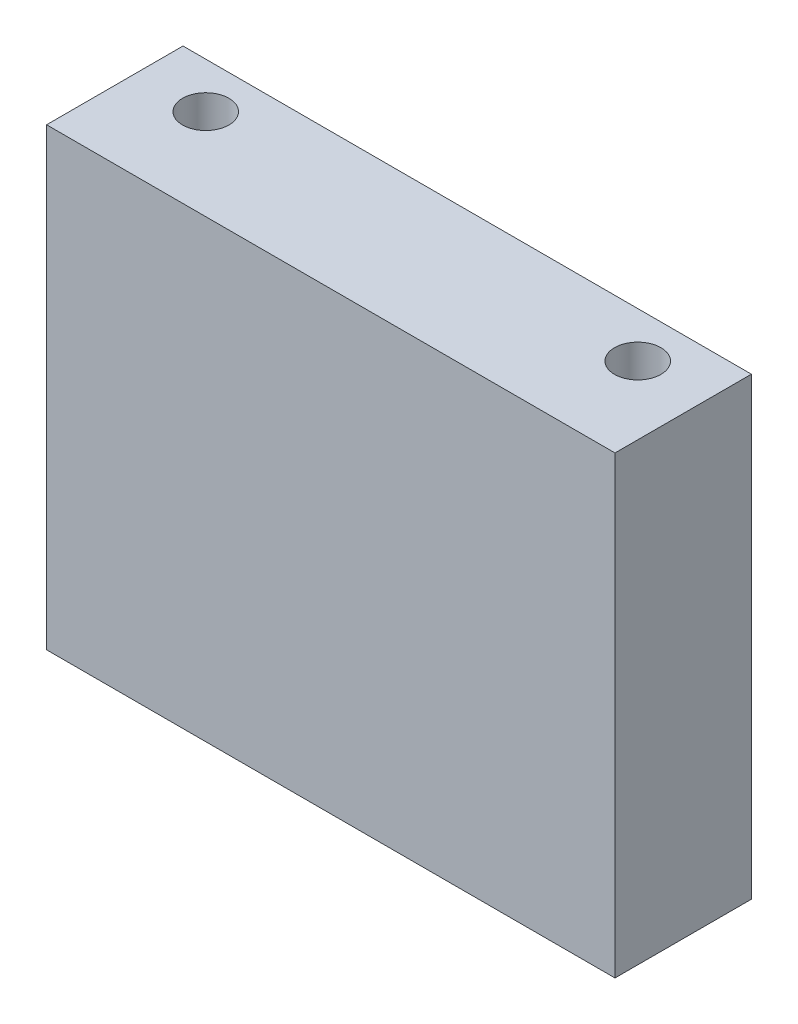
ISO-10303-21;
HEADER;
FILE_DESCRIPTION(('STEP AP214'),'2;1');
FILE_NAME('part.step','',(''),(''),'','','');
FILE_SCHEMA(('AUTOMOTIVE_DESIGN { 1 0 10303 214 1 1 1 1 }'));
ENDSEC;
DATA;
#1=APPLICATION_CONTEXT('core data for automotive mechanical design processes');
#2=APPLICATION_PROTOCOL_DEFINITION('international standard','automotive_design',2000,#1);
#3=PRODUCT_CONTEXT('',#1,'mechanical');
#4=PRODUCT('Part','Part','',(#3));
#5=PRODUCT_RELATED_PRODUCT_CATEGORY('part','',(#4));
#6=PRODUCT_DEFINITION_FORMATION('','',#4);
#7=PRODUCT_DEFINITION_CONTEXT('part definition',#1,'design');
#8=PRODUCT_DEFINITION('design','',#6,#7);
#9=PRODUCT_DEFINITION_SHAPE('','',#8);
#10=(LENGTH_UNIT() NAMED_UNIT(*) SI_UNIT(.MILLI.,.METRE.));
#11=(NAMED_UNIT(*) PLANE_ANGLE_UNIT() SI_UNIT($,.RADIAN.));
#12=(NAMED_UNIT(*) SI_UNIT($,.STERADIAN.) SOLID_ANGLE_UNIT());
#13=UNCERTAINTY_MEASURE_WITH_UNIT(LENGTH_MEASURE(1.E-05),#10,'distance_accuracy_value','');
#14=(GEOMETRIC_REPRESENTATION_CONTEXT(3) GLOBAL_UNCERTAINTY_ASSIGNED_CONTEXT((#13)) GLOBAL_UNIT_ASSIGNED_CONTEXT((#10,
#11,#12)) REPRESENTATION_CONTEXT('',''));
#15=CARTESIAN_POINT('',(0.,0.,0.));
#16=DIRECTION('',(0.,0.,1.));
#17=DIRECTION('',(1.,0.,0.));
#18=AXIS2_PLACEMENT_3D('',#15,#16,#17);
#19=CARTESIAN_POINT('',(-62.5000000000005,0.,30.0000000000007));
#20=DIRECTION('',(1.00000000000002,0.,0.));
#21=DIRECTION('',(0.,1.,0.));
#22=AXIS2_PLACEMENT_3D('',#19,#20,#21);
#23=PLANE('',#22);
#24=DIRECTION('',(0.,-1.,0.));
#25=VECTOR('',#24,1.);
#26=CARTESIAN_POINT('',(-62.5000000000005,0.,1.17961196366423E-13));
#27=LINE('',#26,#25);
#28=CARTESIAN_POINT('',(-62.5000000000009,100.,1.17961196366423E-13));
#29=VERTEX_POINT('',#28);
#30=CARTESIAN_POINT('',(-62.5000000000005,0.,1.17961196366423E-13));
#31=VERTEX_POINT('',#30);
#32=EDGE_CURVE('E204',#29,#31,#27,.T.);
#33=ORIENTED_EDGE('',*,*,#32,.T.);
#34=DIRECTION('',(0.,0.,-1.00000000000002));
#35=VECTOR('',#34,1.);
#36=CARTESIAN_POINT('',(-62.5000000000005,0.,30.0000000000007));
#37=LINE('',#36,#35);
#38=CARTESIAN_POINT('',(-62.5000000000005,0.,30.0000000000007));
#39=VERTEX_POINT('',#38);
#40=EDGE_CURVE('E236',#39,#31,#37,.T.);
#41=ORIENTED_EDGE('',*,*,#40,.F.);
#42=DIRECTION('',(0.,-1.,0.));
#43=VECTOR('',#42,1.);
#44=CARTESIAN_POINT('',(-62.5000000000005,0.,30.0000000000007));
#45=LINE('',#44,#43);
#46=CARTESIAN_POINT('',(-62.5000000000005,100.,30.0000000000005));
#47=VERTEX_POINT('',#46);
#48=EDGE_CURVE('E210',#47,#39,#45,.T.);
#49=ORIENTED_EDGE('',*,*,#48,.F.);
#50=DIRECTION('',(0.,0.,-1.00000000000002));
#51=VECTOR('',#50,1.);
#52=CARTESIAN_POINT('',(-62.5000000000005,100.,30.0000000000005));
#53=LINE('',#52,#51);
#54=EDGE_CURVE('E220',#47,#29,#53,.T.);
#55=ORIENTED_EDGE('',*,*,#54,.T.);
#56=EDGE_LOOP('',(#33,#41,#49,#55));
#57=FACE_BOUND('',#56,.T.);
#58=ADVANCED_FACE('F40',(#57),#23,.F.);
#59=CARTESIAN_POINT('',(-62.5000000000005,0.,30.0000000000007));
#60=DIRECTION('',(0.,1.,0.));
#61=DIRECTION('',(0.,0.,1.00000000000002));
#62=AXIS2_PLACEMENT_3D('',#59,#60,#61);
#63=PLANE('',#62);
#64=DIRECTION('',(1.00000000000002,0.,0.));
#65=VECTOR('',#64,1.);
#66=CARTESIAN_POINT('',(-62.5000000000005,0.,1.17961196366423E-13));
#67=LINE('',#66,#65);
#68=CARTESIAN_POINT('',(62.5000000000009,0.,0.));
#69=VERTEX_POINT('',#68);
#70=EDGE_CURVE('E223',#31,#69,#67,.T.);
#71=ORIENTED_EDGE('',*,*,#70,.T.);
#72=DIRECTION('',(0.,0.,-1.00000000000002));
#73=VECTOR('',#72,1.);
#74=CARTESIAN_POINT('',(62.5000000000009,0.,30.0000000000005));
#75=LINE('',#74,#73);
#76=CARTESIAN_POINT('',(62.5000000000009,0.,30.0000000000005));
#77=VERTEX_POINT('',#76);
#78=EDGE_CURVE('E233',#77,#69,#75,.T.);
#79=ORIENTED_EDGE('',*,*,#78,.F.);
#80=DIRECTION('',(1.00000000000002,0.,0.));
#81=VECTOR('',#80,1.);
#82=CARTESIAN_POINT('',(-62.5000000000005,0.,30.0000000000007));
#83=LINE('',#82,#81);
#84=EDGE_CURVE('E213',#39,#77,#83,.T.);
#85=ORIENTED_EDGE('',*,*,#84,.F.);
#86=ORIENTED_EDGE('',*,*,#40,.T.);
#87=EDGE_LOOP('',(#71,#79,#85,#86));
#88=FACE_BOUND('',#87,.T.);
#89=ADVANCED_FACE('F338',(#88),#63,.F.);
#90=CARTESIAN_POINT('',(62.5000000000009,0.,30.0000000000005));
#91=DIRECTION('',(-1.00000000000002,0.,0.));
#92=DIRECTION('',(0.,-1.,0.));
#93=AXIS2_PLACEMENT_3D('',#90,#91,#92);
#94=PLANE('',#93);
#95=DIRECTION('',(0.,1.,0.));
#96=VECTOR('',#95,1.);
#97=CARTESIAN_POINT('',(62.5000000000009,0.,0.));
#98=LINE('',#97,#96);
#99=CARTESIAN_POINT('',(62.5000000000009,100.,1.17961196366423E-13));
#100=VERTEX_POINT('',#99);
#101=EDGE_CURVE('E225',#69,#100,#98,.T.);
#102=ORIENTED_EDGE('',*,*,#101,.T.);
#103=DIRECTION('',(0.,0.,-1.00000000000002));
#104=VECTOR('',#103,1.);
#105=CARTESIAN_POINT('',(62.5000000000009,100.,30.0000000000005));
#106=LINE('',#105,#104);
#107=CARTESIAN_POINT('',(62.5000000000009,100.,30.0000000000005));
#108=VERTEX_POINT('',#107);
#109=EDGE_CURVE('E230',#108,#100,#106,.T.);
#110=ORIENTED_EDGE('',*,*,#109,.F.);
#111=DIRECTION('',(0.,1.,0.));
#112=VECTOR('',#111,1.);
#113=CARTESIAN_POINT('',(62.5000000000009,0.,30.0000000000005));
#114=LINE('',#113,#112);
#115=EDGE_CURVE('E216',#77,#108,#114,.T.);
#116=ORIENTED_EDGE('',*,*,#115,.F.);
#117=ORIENTED_EDGE('',*,*,#78,.T.);
#118=EDGE_LOOP('',(#102,#110,#116,#117));
#119=FACE_BOUND('',#118,.T.);
#120=ADVANCED_FACE('F344',(#119),#94,.F.);
#121=CARTESIAN_POINT('',(-62.5000000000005,100.,30.0000000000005));
#122=DIRECTION('',(0.,-1.,0.));
#123=DIRECTION('',(1.00000000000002,0.,0.));
#124=AXIS2_PLACEMENT_3D('',#121,#122,#123);
#125=PLANE('',#124);
#126=CARTESIAN_POINT('',(-47.5,100.,10.0000000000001));
#127=DIRECTION('',(0.,1.,0.));
#128=DIRECTION('',(0.,0.,1.));
#129=AXIS2_PLACEMENT_3D('',#126,#127,#128);
#130=CIRCLE('',#129,5.09999999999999);
#131=CARTESIAN_POINT('',(-47.5,100.,15.1000000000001));
#132=VERTEX_POINT('',#131);
#133=EDGE_CURVE('E169',#132,#132,#130,.T.);
#134=ORIENTED_EDGE('',*,*,#133,.F.);
#135=EDGE_LOOP('',(#134));
#136=FACE_BOUND('',#135,.T.);
#137=CARTESIAN_POINT('',(47.5,100.,10.0000000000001));
#138=DIRECTION('',(0.,1.,0.));
#139=DIRECTION('',(0.,0.,1.));
#140=AXIS2_PLACEMENT_3D('',#137,#138,#139);
#141=CIRCLE('',#140,5.09999999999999);
#142=CARTESIAN_POINT('',(47.5,100.,15.1000000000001));
#143=VERTEX_POINT('',#142);
#144=EDGE_CURVE('E168',#143,#143,#141,.T.);
#145=ORIENTED_EDGE('',*,*,#144,.F.);
#146=EDGE_LOOP('',(#145));
#147=FACE_BOUND('',#146,.T.);
#148=DIRECTION('',(-1.00000000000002,0.,0.));
#149=VECTOR('',#148,1.);
#150=CARTESIAN_POINT('',(-62.5000000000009,100.,1.17961196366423E-13));
#151=LINE('',#150,#149);
#152=EDGE_CURVE('E214',#100,#29,#151,.T.);
#153=ORIENTED_EDGE('',*,*,#152,.T.);
#154=ORIENTED_EDGE('',*,*,#54,.F.);
#155=DIRECTION('',(-1.00000000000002,0.,0.));
#156=VECTOR('',#155,1.);
#157=CARTESIAN_POINT('',(-62.5000000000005,100.,30.0000000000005));
#158=LINE('',#157,#156);
#159=EDGE_CURVE('E218',#108,#47,#158,.T.);
#160=ORIENTED_EDGE('',*,*,#159,.F.);
#161=ORIENTED_EDGE('',*,*,#109,.T.);
#162=EDGE_LOOP('',(#153,#154,#160,#161));
#163=FACE_BOUND('',#162,.T.);
#164=ADVANCED_FACE('F423',(#136,#147,#163),#125,.F.);
#165=CARTESIAN_POINT('',(-62.5000000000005,100.,30.0000000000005));
#166=DIRECTION('',(0.,0.,-1.00000000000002));
#167=DIRECTION('',(-1.00000000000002,0.,0.));
#168=AXIS2_PLACEMENT_3D('',#165,#166,#167);
#169=PLANE('',#168);
#170=ORIENTED_EDGE('',*,*,#48,.T.);
#171=ORIENTED_EDGE('',*,*,#84,.T.);
#172=ORIENTED_EDGE('',*,*,#115,.T.);
#173=ORIENTED_EDGE('',*,*,#159,.T.);
#174=EDGE_LOOP('',(#170,#171,#172,#173));
#175=FACE_BOUND('',#174,.T.);
#176=ADVANCED_FACE('F431',(#175),#169,.F.);
#177=CARTESIAN_POINT('',(-62.5000000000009,100.,1.17961196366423E-13));
#178=DIRECTION('',(0.,0.,-1.00000000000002));
#179=DIRECTION('',(-1.00000000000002,0.,0.));
#180=AXIS2_PLACEMENT_3D('',#177,#178,#179);
#181=PLANE('',#180);
#182=CARTESIAN_POINT('',(30.0000000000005,40.0000000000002,1.17961196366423E-13));
#183=DIRECTION('',(0.,0.,-1.00000000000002));
#184=DIRECTION('',(-1.00000000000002,0.,0.));
#185=AXIS2_PLACEMENT_3D('',#182,#183,#184);
#186=CIRCLE('',#185,20.);
#187=CARTESIAN_POINT('',(30.0000000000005,60.0000000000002,1.17961196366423E-13));
#188=VERTEX_POINT('',#187);
#189=CARTESIAN_POINT('',(30.0000000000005,20.,1.17961196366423E-13));
#190=VERTEX_POINT('',#189);
#191=EDGE_CURVE('E182',#188,#190,#186,.T.);
#192=ORIENTED_EDGE('',*,*,#191,.F.);
#193=DIRECTION('',(1.00000000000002,0.,0.));
#194=VECTOR('',#193,1.);
#195=CARTESIAN_POINT('',(30.0000000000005,60.0000000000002,1.17961196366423E-13));
#196=LINE('',#195,#194);
#197=CARTESIAN_POINT('',(-30.0000000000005,60.,0.));
#198=VERTEX_POINT('',#197);
#199=EDGE_CURVE('E198',#198,#188,#196,.T.);
#200=ORIENTED_EDGE('',*,*,#199,.F.);
#201=CARTESIAN_POINT('',(-30.0000000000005,40.,1.17961196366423E-13));
#202=DIRECTION('',(0.,0.,-1.00000000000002));
#203=DIRECTION('',(1.00000000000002,0.,0.));
#204=AXIS2_PLACEMENT_3D('',#201,#202,#203);
#205=CIRCLE('',#204,20.);
#206=CARTESIAN_POINT('',(-30.0000000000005,20.,1.17961196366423E-13));
#207=VERTEX_POINT('',#206);
#208=EDGE_CURVE('E195',#207,#198,#205,.T.);
#209=ORIENTED_EDGE('',*,*,#208,.F.);
#210=DIRECTION('',(-1.00000000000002,0.,0.));
#211=VECTOR('',#210,1.);
#212=CARTESIAN_POINT('',(30.0000000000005,20.,1.17961196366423E-13));
#213=LINE('',#212,#211);
#214=EDGE_CURVE('E192',#190,#207,#213,.T.);
#215=ORIENTED_EDGE('',*,*,#214,.F.);
#216=EDGE_LOOP('',(#192,#200,#209,#215));
#217=FACE_BOUND('',#216,.T.);
#218=ORIENTED_EDGE('',*,*,#32,.F.);
#219=ORIENTED_EDGE('',*,*,#152,.F.);
#220=ORIENTED_EDGE('',*,*,#101,.F.);
#221=ORIENTED_EDGE('',*,*,#70,.F.);
#222=EDGE_LOOP('',(#218,#219,#220,#221));
#223=FACE_BOUND('',#222,.T.);
#224=ADVANCED_FACE('F439',(#217,#223),#181,.T.);
#225=CARTESIAN_POINT('',(30.0000000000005,40.0000000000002,20.5000000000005));
#226=DIRECTION('',(0.,0.,-1.00000000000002));
#227=DIRECTION('',(-1.00000000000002,0.,0.));
#228=AXIS2_PLACEMENT_3D('',#225,#226,#227);
#229=CYLINDRICAL_SURFACE('',#228,20.);
#230=DIRECTION('',(0.,0.,-1.00000000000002));
#231=VECTOR('',#230,1.);
#232=CARTESIAN_POINT('',(30.0000000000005,20.,20.5000000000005));
#233=LINE('',#232,#231);
#234=CARTESIAN_POINT('',(30.0000000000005,20.,19.5000000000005));
#235=VERTEX_POINT('',#234);
#236=EDGE_CURVE('E201',#235,#190,#233,.T.);
#237=ORIENTED_EDGE('',*,*,#236,.F.);
#238=CARTESIAN_POINT('',(30.0000000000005,40.0000000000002,19.5000000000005));
#239=DIRECTION('',(0.,0.,-1.00000000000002));
#240=DIRECTION('',(-1.00000000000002,0.,0.));
#241=AXIS2_PLACEMENT_3D('',#238,#239,#240);
#242=CIRCLE('',#241,20.);
#243=CARTESIAN_POINT('',(30.0000000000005,60.0000000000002,19.5000000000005));
#244=VERTEX_POINT('',#243);
#245=EDGE_CURVE('E260',#235,#244,#242,.F.);
#246=ORIENTED_EDGE('',*,*,#245,.T.);
#247=DIRECTION('',(0.,0.,-1.00000000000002));
#248=VECTOR('',#247,1.);
#249=CARTESIAN_POINT('',(30.0000000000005,60.0000000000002,20.5000000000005));
#250=LINE('',#249,#248);
#251=EDGE_CURVE('E202',#244,#188,#250,.T.);
#252=ORIENTED_EDGE('',*,*,#251,.T.);
#253=ORIENTED_EDGE('',*,*,#191,.T.);
#254=EDGE_LOOP('',(#237,#246,#252,#253));
#255=FACE_BOUND('',#254,.T.);
#256=ADVANCED_FACE('F447',(#255),#229,.F.);
#257=CARTESIAN_POINT('',(30.0000000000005,60.0000000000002,20.5000000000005));
#258=DIRECTION('',(0.,1.,0.));
#259=DIRECTION('',(-1.00000000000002,0.,0.));
#260=AXIS2_PLACEMENT_3D('',#257,#258,#259);
#261=PLANE('',#260);
#262=ORIENTED_EDGE('',*,*,#251,.F.);
#263=DIRECTION('',(1.00000000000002,0.,0.));
#264=VECTOR('',#263,1.);
#265=CARTESIAN_POINT('',(30.0000000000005,60.0000000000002,19.5000000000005));
#266=LINE('',#265,#264);
#267=CARTESIAN_POINT('',(-30.0000000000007,60.,19.5000000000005));
#268=VERTEX_POINT('',#267);
#269=EDGE_CURVE('E277',#244,#268,#266,.F.);
#270=ORIENTED_EDGE('',*,*,#269,.T.);
#271=DIRECTION('',(0.,0.,-1.00000000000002));
#272=VECTOR('',#271,1.);
#273=CARTESIAN_POINT('',(-30.0000000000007,60.,20.5000000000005));
#274=LINE('',#273,#272);
#275=EDGE_CURVE('E205',#268,#198,#274,.T.);
#276=ORIENTED_EDGE('',*,*,#275,.T.);
#277=ORIENTED_EDGE('',*,*,#199,.T.);
#278=EDGE_LOOP('',(#262,#270,#276,#277));
#279=FACE_BOUND('',#278,.T.);
#280=ADVANCED_FACE('F455',(#279),#261,.F.);
#281=CARTESIAN_POINT('',(-30.0000000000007,40.,20.5000000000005));
#282=DIRECTION('',(0.,0.,-1.00000000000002));
#283=DIRECTION('',(-1.00000000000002,0.,0.));
#284=AXIS2_PLACEMENT_3D('',#281,#282,#283);
#285=CYLINDRICAL_SURFACE('',#284,20.);
#286=ORIENTED_EDGE('',*,*,#275,.F.);
#287=CARTESIAN_POINT('',(-30.0000000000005,40.,19.5000000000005));
#288=DIRECTION('',(0.,0.,-1.00000000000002));
#289=DIRECTION('',(-1.00000000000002,0.,0.));
#290=AXIS2_PLACEMENT_3D('',#287,#288,#289);
#291=CIRCLE('',#290,20.);
#292=CARTESIAN_POINT('',(-30.0000000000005,20.0000000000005,19.5000000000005));
#293=VERTEX_POINT('',#292);
#294=EDGE_CURVE('E49',#268,#293,#291,.F.);
#295=ORIENTED_EDGE('',*,*,#294,.T.);
#296=DIRECTION('',(0.,0.,-1.00000000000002));
#297=VECTOR('',#296,1.);
#298=CARTESIAN_POINT('',(-30.0000000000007,20.0000000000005,20.5000000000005));
#299=LINE('',#298,#297);
#300=EDGE_CURVE('E207',#293,#207,#299,.T.);
#301=ORIENTED_EDGE('',*,*,#300,.T.);
#302=ORIENTED_EDGE('',*,*,#208,.T.);
#303=EDGE_LOOP('',(#286,#295,#301,#302));
#304=FACE_BOUND('',#303,.T.);
#305=ADVANCED_FACE('F463',(#304),#285,.F.);
#306=CARTESIAN_POINT('',(30.0000000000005,20.,20.5000000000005));
#307=DIRECTION('',(0.,-1.,0.));
#308=DIRECTION('',(0.,0.,-1.00000000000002));
#309=AXIS2_PLACEMENT_3D('',#306,#307,#308);
#310=PLANE('',#309);
#311=ORIENTED_EDGE('',*,*,#300,.F.);
#312=DIRECTION('',(-1.00000000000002,0.,0.));
#313=VECTOR('',#312,1.);
#314=CARTESIAN_POINT('',(30.0000000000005,20.,19.5000000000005));
#315=LINE('',#314,#313);
#316=EDGE_CURVE('E275',#293,#235,#315,.F.);
#317=ORIENTED_EDGE('',*,*,#316,.T.);
#318=ORIENTED_EDGE('',*,*,#236,.T.);
#319=ORIENTED_EDGE('',*,*,#214,.T.);
#320=EDGE_LOOP('',(#311,#317,#318,#319));
#321=FACE_BOUND('',#320,.T.);
#322=ADVANCED_FACE('F471',(#321),#310,.F.);
#323=CARTESIAN_POINT('',(30.0000000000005,40.0000000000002,20.5000000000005));
#324=DIRECTION('',(0.,0.,-1.00000000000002));
#325=DIRECTION('',(-1.00000000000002,0.,0.));
#326=AXIS2_PLACEMENT_3D('',#323,#324,#325);
#327=PLANE('',#326);
#328=DIRECTION('',(1.00000000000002,0.,0.));
#329=VECTOR('',#328,1.);
#330=CARTESIAN_POINT('',(30.0000000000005,59.0000000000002,20.5000000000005));
#331=LINE('',#330,#329);
#332=CARTESIAN_POINT('',(-30.0000000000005,59.,20.5000000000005));
#333=VERTEX_POINT('',#332);
#334=CARTESIAN_POINT('',(30.0000000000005,59.0000000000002,20.5000000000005));
#335=VERTEX_POINT('',#334);
#336=EDGE_CURVE('E253',#333,#335,#331,.T.);
#337=ORIENTED_EDGE('',*,*,#336,.T.);
#338=CARTESIAN_POINT('',(30.0000000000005,40.0000000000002,20.5000000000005));
#339=DIRECTION('',(0.,0.,-1.00000000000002));
#340=DIRECTION('',(-1.00000000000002,0.,0.));
#341=AXIS2_PLACEMENT_3D('',#338,#339,#340);
#342=CIRCLE('',#341,19.);
#343=CARTESIAN_POINT('',(30.0000000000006,21.,20.5000000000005));
#344=VERTEX_POINT('',#343);
#345=EDGE_CURVE('E257',#335,#344,#342,.T.);
#346=ORIENTED_EDGE('',*,*,#345,.T.);
#347=DIRECTION('',(-1.00000000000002,0.,0.));
#348=VECTOR('',#347,1.);
#349=CARTESIAN_POINT('',(30.0000000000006,21.,20.5000000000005));
#350=LINE('',#349,#348);
#351=CARTESIAN_POINT('',(-30.0000000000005,21.0000000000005,20.5000000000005));
#352=VERTEX_POINT('',#351);
#353=EDGE_CURVE('E255',#344,#352,#350,.T.);
#354=ORIENTED_EDGE('',*,*,#353,.T.);
#355=CARTESIAN_POINT('',(-30.0000000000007,40.,20.5000000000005));
#356=DIRECTION('',(0.,0.,-1.00000000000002));
#357=DIRECTION('',(-1.00000000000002,0.,0.));
#358=AXIS2_PLACEMENT_3D('',#355,#356,#357);
#359=CIRCLE('',#358,19.);
#360=EDGE_CURVE('E251',#352,#333,#359,.T.);
#361=ORIENTED_EDGE('',*,*,#360,.T.);
#362=EDGE_LOOP('',(#337,#346,#354,#361));
#363=FACE_BOUND('',#362,.T.);
#364=CARTESIAN_POINT('',(-30.0000000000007,40.,20.5000000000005));
#365=DIRECTION('',(0.,0.,-1.00000000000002));
#366=DIRECTION('',(-1.00000000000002,0.,0.));
#367=AXIS2_PLACEMENT_3D('',#364,#365,#366);
#368=CIRCLE('',#367,18.);
#369=CARTESIAN_POINT('',(-30.0000000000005,22.0000000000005,20.5000000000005));
#370=VERTEX_POINT('',#369);
#371=CARTESIAN_POINT('',(-30.0000000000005,58.,20.5000000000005));
#372=VERTEX_POINT('',#371);
#373=EDGE_CURVE('E248',#370,#372,#368,.T.);
#374=ORIENTED_EDGE('',*,*,#373,.F.);
#375=DIRECTION('',(-1.00000000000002,0.,0.));
#376=VECTOR('',#375,1.);
#377=CARTESIAN_POINT('',(30.0000000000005,22.,20.5000000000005));
#378=LINE('',#377,#376);
#379=CARTESIAN_POINT('',(30.0000000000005,22.,20.5000000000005));
#380=VERTEX_POINT('',#379);
#381=EDGE_CURVE('E245',#380,#370,#378,.T.);
#382=ORIENTED_EDGE('',*,*,#381,.F.);
#383=CARTESIAN_POINT('',(30.0000000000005,40.0000000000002,20.5000000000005));
#384=DIRECTION('',(0.,0.,-1.00000000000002));
#385=DIRECTION('',(-1.00000000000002,0.,0.));
#386=AXIS2_PLACEMENT_3D('',#383,#384,#385);
#387=CIRCLE('',#386,18.);
#388=CARTESIAN_POINT('',(30.0000000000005,58.0000000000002,20.5000000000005));
#389=VERTEX_POINT('',#388);
#390=EDGE_CURVE('E242',#389,#380,#387,.T.);
#391=ORIENTED_EDGE('',*,*,#390,.F.);
#392=DIRECTION('',(1.00000000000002,0.,0.));
#393=VECTOR('',#392,1.);
#394=CARTESIAN_POINT('',(30.0000000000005,58.0000000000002,20.5000000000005));
#395=LINE('',#394,#393);
#396=EDGE_CURVE('E239',#372,#389,#395,.T.);
#397=ORIENTED_EDGE('',*,*,#396,.F.);
#398=EDGE_LOOP('',(#374,#382,#391,#397));
#399=FACE_BOUND('',#398,.T.);
#400=ADVANCED_FACE('F479',(#363,#399),#327,.T.);
#401=CARTESIAN_POINT('',(-30.0000000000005,40.,24.0000000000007));
#402=DIRECTION('',(0.,0.,-1.00000000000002));
#403=DIRECTION('',(-1.00000000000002,0.,0.));
#404=AXIS2_PLACEMENT_3D('',#401,#402,#403);
#405=CYLINDRICAL_SURFACE('',#404,18.);
#406=DIRECTION('',(0.,0.,-1.00000000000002));
#407=VECTOR('',#406,1.);
#408=CARTESIAN_POINT('',(-30.0000000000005,58.,24.0000000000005));
#409=LINE('',#408,#407);
#410=CARTESIAN_POINT('',(-30.0000000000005,58.0000000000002,23.0000000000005));
#411=VERTEX_POINT('',#410);
#412=EDGE_CURVE('E187',#411,#372,#409,.T.);
#413=ORIENTED_EDGE('',*,*,#412,.F.);
#414=CARTESIAN_POINT('',(-30.0000000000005,40.0000000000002,23.0000000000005));
#415=DIRECTION('',(0.,0.,-1.00000000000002));
#416=DIRECTION('',(-1.00000000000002,0.,0.));
#417=AXIS2_PLACEMENT_3D('',#414,#415,#416);
#418=CIRCLE('',#417,18.);
#419=CARTESIAN_POINT('',(-30.0000000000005,22.,23.0000000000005));
#420=VERTEX_POINT('',#419);
#421=EDGE_CURVE('E11',#411,#420,#418,.F.);
#422=ORIENTED_EDGE('',*,*,#421,.T.);
#423=DIRECTION('',(0.,0.,-1.00000000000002));
#424=VECTOR('',#423,1.);
#425=CARTESIAN_POINT('',(-30.0000000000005,22.,24.0000000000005));
#426=LINE('',#425,#424);
#427=EDGE_CURVE('E180',#420,#370,#426,.T.);
#428=ORIENTED_EDGE('',*,*,#427,.T.);
#429=ORIENTED_EDGE('',*,*,#373,.T.);
#430=EDGE_LOOP('',(#413,#422,#428,#429));
#431=FACE_BOUND('',#430,.T.);
#432=ADVANCED_FACE('F487',(#431),#405,.F.);
#433=CARTESIAN_POINT('',(30.0000000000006,22.,24.0000000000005));
#434=DIRECTION('',(0.,-1.,0.));
#435=DIRECTION('',(0.,0.,-1.00000000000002));
#436=AXIS2_PLACEMENT_3D('',#433,#434,#435);
#437=PLANE('',#436);
#438=ORIENTED_EDGE('',*,*,#427,.F.);
#439=DIRECTION('',(-1.00000000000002,0.,0.));
#440=VECTOR('',#439,1.);
#441=CARTESIAN_POINT('',(30.0000000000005,22.,23.0000000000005));
#442=LINE('',#441,#440);
#443=CARTESIAN_POINT('',(30.0000000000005,22.,23.0000000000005));
#444=VERTEX_POINT('',#443);
#445=EDGE_CURVE('E279',#420,#444,#442,.F.);
#446=ORIENTED_EDGE('',*,*,#445,.T.);
#447=DIRECTION('',(0.,0.,-1.00000000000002));
#448=VECTOR('',#447,1.);
#449=CARTESIAN_POINT('',(30.0000000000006,22.,24.0000000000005));
#450=LINE('',#449,#448);
#451=EDGE_CURVE('E183',#444,#380,#450,.T.);
#452=ORIENTED_EDGE('',*,*,#451,.T.);
#453=ORIENTED_EDGE('',*,*,#381,.T.);
#454=EDGE_LOOP('',(#438,#446,#452,#453));
#455=FACE_BOUND('',#454,.T.);
#456=ADVANCED_FACE('F312',(#455),#437,.F.);
#457=CARTESIAN_POINT('',(30.0000000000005,40.0000000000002,24.0000000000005));
#458=DIRECTION('',(0.,0.,-1.00000000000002));
#459=DIRECTION('',(-1.00000000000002,0.,0.));
#460=AXIS2_PLACEMENT_3D('',#457,#458,#459);
#461=CYLINDRICAL_SURFACE('',#460,18.);
#462=ORIENTED_EDGE('',*,*,#451,.F.);
#463=CARTESIAN_POINT('',(30.0000000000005,40.0000000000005,23.0000000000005));
#464=DIRECTION('',(0.,0.,-1.00000000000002));
#465=DIRECTION('',(-1.00000000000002,0.,0.));
#466=AXIS2_PLACEMENT_3D('',#463,#464,#465);
#467=CIRCLE('',#466,18.);
#468=CARTESIAN_POINT('',(30.0000000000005,58.0000000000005,23.0000000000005));
#469=VERTEX_POINT('',#468);
#470=EDGE_CURVE('E272',#444,#469,#467,.F.);
#471=ORIENTED_EDGE('',*,*,#470,.T.);
#472=DIRECTION('',(0.,0.,-1.00000000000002));
#473=VECTOR('',#472,1.);
#474=CARTESIAN_POINT('',(30.0000000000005,58.0000000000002,24.0000000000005));
#475=LINE('',#474,#473);
#476=EDGE_CURVE('E185',#469,#389,#475,.T.);
#477=ORIENTED_EDGE('',*,*,#476,.T.);
#478=ORIENTED_EDGE('',*,*,#390,.T.);
#479=EDGE_LOOP('',(#462,#471,#477,#478));
#480=FACE_BOUND('',#479,.T.);
#481=ADVANCED_FACE('F315',(#480),#461,.F.);
#482=CARTESIAN_POINT('',(-30.0000000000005,58.,24.0000000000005));
#483=DIRECTION('',(0.,1.,0.));
#484=DIRECTION('',(-1.00000000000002,0.,0.));
#485=AXIS2_PLACEMENT_3D('',#482,#483,#484);
#486=PLANE('',#485);
#487=ORIENTED_EDGE('',*,*,#476,.F.);
#488=DIRECTION('',(1.00000000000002,0.,0.));
#489=VECTOR('',#488,1.);
#490=CARTESIAN_POINT('',(-30.0000000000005,58.0000000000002,23.0000000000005));
#491=LINE('',#490,#489);
#492=EDGE_CURVE('E57',#469,#411,#491,.F.);
#493=ORIENTED_EDGE('',*,*,#492,.T.);
#494=ORIENTED_EDGE('',*,*,#412,.T.);
#495=ORIENTED_EDGE('',*,*,#396,.T.);
#496=EDGE_LOOP('',(#487,#493,#494,#495));
#497=FACE_BOUND('',#496,.T.);
#498=ADVANCED_FACE('F325',(#497),#486,.F.);
#499=CARTESIAN_POINT('',(-30.0000000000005,40.,24.0000000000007));
#500=DIRECTION('',(0.,0.,-1.00000000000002));
#501=DIRECTION('',(-1.00000000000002,0.,0.));
#502=AXIS2_PLACEMENT_3D('',#499,#500,#501);
#503=PLANE('',#502);
#504=DIRECTION('',(1.00000000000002,0.,0.));
#505=VECTOR('',#504,1.);
#506=CARTESIAN_POINT('',(-30.0000000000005,57.,24.0000000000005));
#507=LINE('',#506,#505);
#508=CARTESIAN_POINT('',(-30.0000000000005,57.,24.0000000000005));
#509=VERTEX_POINT('',#508);
#510=CARTESIAN_POINT('',(30.0000000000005,57.0000000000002,24.0000000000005));
#511=VERTEX_POINT('',#510);
#512=EDGE_CURVE('E265',#509,#511,#507,.T.);
#513=ORIENTED_EDGE('',*,*,#512,.T.);
#514=CARTESIAN_POINT('',(30.0000000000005,40.0000000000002,24.0000000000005));
#515=DIRECTION('',(0.,0.,-1.00000000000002));
#516=DIRECTION('',(-1.00000000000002,0.,0.));
#517=AXIS2_PLACEMENT_3D('',#514,#515,#516);
#518=CIRCLE('',#517,17.);
#519=CARTESIAN_POINT('',(30.0000000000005,23.,24.0000000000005));
#520=VERTEX_POINT('',#519);
#521=EDGE_CURVE('E269',#511,#520,#518,.T.);
#522=ORIENTED_EDGE('',*,*,#521,.T.);
#523=DIRECTION('',(-1.00000000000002,0.,0.));
#524=VECTOR('',#523,1.);
#525=CARTESIAN_POINT('',(-30.0000000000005,23.,24.0000000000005));
#526=LINE('',#525,#524);
#527=CARTESIAN_POINT('',(-30.0000000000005,23.,24.0000000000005));
#528=VERTEX_POINT('',#527);
#529=EDGE_CURVE('E267',#520,#528,#526,.T.);
#530=ORIENTED_EDGE('',*,*,#529,.T.);
#531=CARTESIAN_POINT('',(-30.0000000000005,40.,24.0000000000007));
#532=DIRECTION('',(0.,0.,-1.00000000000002));
#533=DIRECTION('',(-1.00000000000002,0.,0.));
#534=AXIS2_PLACEMENT_3D('',#531,#532,#533);
#535=CIRCLE('',#534,17.);
#536=EDGE_CURVE('E263',#528,#509,#535,.T.);
#537=ORIENTED_EDGE('',*,*,#536,.T.);
#538=EDGE_LOOP('',(#513,#522,#530,#537));
#539=FACE_BOUND('',#538,.T.);
#540=ADVANCED_FACE('F322',(#539),#503,.T.);
#541=CARTESIAN_POINT('',(-30.0000000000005,40.,19.5000000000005));
#542=DIRECTION('',(0.,0.,-1.00000000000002));
#543=DIRECTION('',(-1.00000000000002,0.,0.));
#544=AXIS2_PLACEMENT_3D('',#541,#542,#543);
#545=TOROIDAL_SURFACE('',#544,19.,1.);
#546=CARTESIAN_POINT('',(-30.0000000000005,21.0000000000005,19.5000000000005));
#547=DIRECTION('',(-1.00000000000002,0.,0.));
#548=DIRECTION('',(0.,0.,1.00000000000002));
#549=AXIS2_PLACEMENT_3D('',#546,#547,#548);
#550=CIRCLE('',#549,1.);
#551=EDGE_CURVE('E287',#293,#352,#550,.T.);
#552=ORIENTED_EDGE('',*,*,#551,.F.);
#553=ORIENTED_EDGE('',*,*,#294,.F.);
#554=CARTESIAN_POINT('',(-30.0000000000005,59.,19.5000000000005));
#555=DIRECTION('',(-1.00000000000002,0.,0.));
#556=DIRECTION('',(0.,0.,1.00000000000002));
#557=AXIS2_PLACEMENT_3D('',#554,#555,#556);
#558=CIRCLE('',#557,1.);
#559=EDGE_CURVE('E189',#333,#268,#558,.T.);
#560=ORIENTED_EDGE('',*,*,#559,.F.);
#561=ORIENTED_EDGE('',*,*,#360,.F.);
#562=EDGE_LOOP('',(#552,#553,#560,#561));
#563=FACE_BOUND('',#562,.T.);
#564=ADVANCED_FACE('F324',(#563),#545,.F.);
#565=CARTESIAN_POINT('',(30.0000000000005,59.0000000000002,19.5000000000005));
#566=DIRECTION('',(1.00000000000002,0.,0.));
#567=DIRECTION('',(0.,1.,0.));
#568=AXIS2_PLACEMENT_3D('',#565,#566,#567);
#569=CYLINDRICAL_SURFACE('',#568,1.);
#570=ORIENTED_EDGE('',*,*,#559,.T.);
#571=ORIENTED_EDGE('',*,*,#269,.F.);
#572=CARTESIAN_POINT('',(30.0000000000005,59.0000000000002,19.5000000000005));
#573=DIRECTION('',(-1.00000000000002,0.,0.));
#574=DIRECTION('',(0.,0.,1.00000000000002));
#575=AXIS2_PLACEMENT_3D('',#572,#573,#574);
#576=CIRCLE('',#575,1.);
#577=EDGE_CURVE('E285',#335,#244,#576,.T.);
#578=ORIENTED_EDGE('',*,*,#577,.F.);
#579=ORIENTED_EDGE('',*,*,#336,.F.);
#580=EDGE_LOOP('',(#570,#571,#578,#579));
#581=FACE_BOUND('',#580,.T.);
#582=ADVANCED_FACE('F331',(#581),#569,.F.);
#583=CARTESIAN_POINT('',(30.0000000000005,21.,19.5000000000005));
#584=DIRECTION('',(-1.00000000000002,0.,0.));
#585=DIRECTION('',(0.,0.,1.00000000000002));
#586=AXIS2_PLACEMENT_3D('',#583,#584,#585);
#587=CYLINDRICAL_SURFACE('',#586,1.);
#588=ORIENTED_EDGE('',*,*,#551,.T.);
#589=ORIENTED_EDGE('',*,*,#353,.F.);
#590=CARTESIAN_POINT('',(30.0000000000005,21.,19.5000000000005));
#591=DIRECTION('',(-1.00000000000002,0.,0.));
#592=DIRECTION('',(0.,0.,1.00000000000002));
#593=AXIS2_PLACEMENT_3D('',#590,#591,#592);
#594=CIRCLE('',#593,1.);
#595=EDGE_CURVE('E283',#235,#344,#594,.T.);
#596=ORIENTED_EDGE('',*,*,#595,.F.);
#597=ORIENTED_EDGE('',*,*,#316,.F.);
#598=EDGE_LOOP('',(#588,#589,#596,#597));
#599=FACE_BOUND('',#598,.T.);
#600=ADVANCED_FACE('F352',(#599),#587,.F.);
#601=CARTESIAN_POINT('',(30.0000000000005,40.0000000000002,19.5000000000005));
#602=DIRECTION('',(0.,0.,-1.00000000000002));
#603=DIRECTION('',(-1.00000000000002,0.,0.));
#604=AXIS2_PLACEMENT_3D('',#601,#602,#603);
#605=TOROIDAL_SURFACE('',#604,19.,1.);
#606=ORIENTED_EDGE('',*,*,#577,.T.);
#607=ORIENTED_EDGE('',*,*,#245,.F.);
#608=ORIENTED_EDGE('',*,*,#595,.T.);
#609=ORIENTED_EDGE('',*,*,#345,.F.);
#610=EDGE_LOOP('',(#606,#607,#608,#609));
#611=FACE_BOUND('',#610,.T.);
#612=ADVANCED_FACE('F349',(#611),#605,.F.);
#613=CARTESIAN_POINT('',(-30.0000000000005,40.0000000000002,23.0000000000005));
#614=DIRECTION('',(0.,0.,-1.00000000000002));
#615=DIRECTION('',(-1.00000000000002,0.,0.));
#616=AXIS2_PLACEMENT_3D('',#613,#614,#615);
#617=TOROIDAL_SURFACE('',#616,17.,1.);
#618=CARTESIAN_POINT('',(-30.0000000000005,23.,23.0000000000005));
#619=DIRECTION('',(-1.00000000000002,0.,0.));
#620=DIRECTION('',(0.,0.,1.00000000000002));
#621=AXIS2_PLACEMENT_3D('',#618,#619,#620);
#622=CIRCLE('',#621,1.);
#623=EDGE_CURVE('E294',#420,#528,#622,.T.);
#624=ORIENTED_EDGE('',*,*,#623,.F.);
#625=ORIENTED_EDGE('',*,*,#421,.F.);
#626=CARTESIAN_POINT('',(-30.0000000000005,57.0000000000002,23.0000000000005));
#627=DIRECTION('',(-1.00000000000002,0.,0.));
#628=DIRECTION('',(0.,0.,1.00000000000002));
#629=AXIS2_PLACEMENT_3D('',#626,#627,#628);
#630=CIRCLE('',#629,1.);
#631=EDGE_CURVE('E44',#509,#411,#630,.T.);
#632=ORIENTED_EDGE('',*,*,#631,.F.);
#633=ORIENTED_EDGE('',*,*,#536,.F.);
#634=EDGE_LOOP('',(#624,#625,#632,#633));
#635=FACE_BOUND('',#634,.T.);
#636=ADVANCED_FACE('F42',(#635),#617,.F.);
#637=CARTESIAN_POINT('',(-30.0000000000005,57.0000000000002,23.0000000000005));
#638=DIRECTION('',(1.00000000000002,0.,0.));
#639=DIRECTION('',(0.,1.,0.));
#640=AXIS2_PLACEMENT_3D('',#637,#638,#639);
#641=CYLINDRICAL_SURFACE('',#640,1.);
#642=ORIENTED_EDGE('',*,*,#631,.T.);
#643=ORIENTED_EDGE('',*,*,#492,.F.);
#644=CARTESIAN_POINT('',(30.0000000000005,57.0000000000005,23.0000000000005));
#645=DIRECTION('',(-1.00000000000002,0.,0.));
#646=DIRECTION('',(0.,0.,1.00000000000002));
#647=AXIS2_PLACEMENT_3D('',#644,#645,#646);
#648=CIRCLE('',#647,1.);
#649=EDGE_CURVE('E293',#511,#469,#648,.T.);
#650=ORIENTED_EDGE('',*,*,#649,.F.);
#651=ORIENTED_EDGE('',*,*,#512,.F.);
#652=EDGE_LOOP('',(#642,#643,#650,#651));
#653=FACE_BOUND('',#652,.T.);
#654=ADVANCED_FACE('F304',(#653),#641,.F.);
#655=CARTESIAN_POINT('',(-30.0000000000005,23.,23.0000000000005));
#656=DIRECTION('',(-1.00000000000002,0.,0.));
#657=DIRECTION('',(0.,0.,1.00000000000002));
#658=AXIS2_PLACEMENT_3D('',#655,#656,#657);
#659=CYLINDRICAL_SURFACE('',#658,1.);
#660=ORIENTED_EDGE('',*,*,#623,.T.);
#661=ORIENTED_EDGE('',*,*,#529,.F.);
#662=CARTESIAN_POINT('',(30.0000000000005,23.,23.0000000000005));
#663=DIRECTION('',(-1.00000000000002,0.,0.));
#664=DIRECTION('',(0.,0.,1.00000000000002));
#665=AXIS2_PLACEMENT_3D('',#662,#663,#664);
#666=CIRCLE('',#665,1.);
#667=EDGE_CURVE('E179',#444,#520,#666,.T.);
#668=ORIENTED_EDGE('',*,*,#667,.F.);
#669=ORIENTED_EDGE('',*,*,#445,.F.);
#670=EDGE_LOOP('',(#660,#661,#668,#669));
#671=FACE_BOUND('',#670,.T.);
#672=ADVANCED_FACE('F309',(#671),#659,.F.);
#673=CARTESIAN_POINT('',(30.0000000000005,40.0000000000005,23.0000000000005));
#674=DIRECTION('',(0.,0.,-1.00000000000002));
#675=DIRECTION('',(-1.00000000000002,0.,0.));
#676=AXIS2_PLACEMENT_3D('',#673,#674,#675);
#677=TOROIDAL_SURFACE('',#676,17.,1.);
#678=ORIENTED_EDGE('',*,*,#649,.T.);
#679=ORIENTED_EDGE('',*,*,#470,.F.);
#680=ORIENTED_EDGE('',*,*,#667,.T.);
#681=ORIENTED_EDGE('',*,*,#521,.F.);
#682=EDGE_LOOP('',(#678,#679,#680,#681));
#683=FACE_BOUND('',#682,.T.);
#684=ADVANCED_FACE('F319',(#683),#677,.F.);
#685=CARTESIAN_POINT('',(47.5,67.25,10.0000000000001));
#686=DIRECTION('',(0.,1.,0.));
#687=DIRECTION('',(0.,0.,1.));
#688=AXIS2_PLACEMENT_3D('',#685,#686,#687);
#689=CONICAL_SURFACE('',#688,5.09999999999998,1.02974425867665);
#690=CARTESIAN_POINT('',(47.5,64.1856108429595,10.0000000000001));
#691=VERTEX_POINT('',#690);
#692=VERTEX_LOOP('',#691);
#693=FACE_BOUND('',#692,.T.);
#694=CARTESIAN_POINT('',(47.5,67.25,10.0000000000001));
#695=DIRECTION('',(0.,1.,0.));
#696=DIRECTION('',(0.,0.,1.));
#697=AXIS2_PLACEMENT_3D('',#694,#695,#696);
#698=CIRCLE('',#697,5.09999999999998);
#699=CARTESIAN_POINT('',(47.5,67.25,15.1000000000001));
#700=VERTEX_POINT('',#699);
#701=EDGE_CURVE('E172',#700,#700,#698,.T.);
#702=ORIENTED_EDGE('',*,*,#701,.T.);
#703=EDGE_LOOP('',(#702));
#704=FACE_BOUND('',#703,.T.);
#705=ADVANCED_FACE('F362',(#693,#704),#689,.F.);
#706=CARTESIAN_POINT('',(47.5,100.,10.0000000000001));
#707=DIRECTION('',(0.,1.,0.));
#708=DIRECTION('',(0.,0.,1.));
#709=AXIS2_PLACEMENT_3D('',#706,#707,#708);
#710=CYLINDRICAL_SURFACE('',#709,5.09999999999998);
#711=ORIENTED_EDGE('',*,*,#701,.F.);
#712=EDGE_LOOP('',(#711));
#713=FACE_BOUND('',#712,.T.);
#714=ORIENTED_EDGE('',*,*,#144,.T.);
#715=EDGE_LOOP('',(#714));
#716=FACE_BOUND('',#715,.T.);
#717=ADVANCED_FACE('F162',(#713,#716),#710,.F.);
#718=CARTESIAN_POINT('',(-47.5,67.25,10.0000000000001));
#719=DIRECTION('',(0.,1.,0.));
#720=DIRECTION('',(0.,0.,1.));
#721=AXIS2_PLACEMENT_3D('',#718,#719,#720);
#722=CONICAL_SURFACE('',#721,5.09999999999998,1.02974425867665);
#723=CARTESIAN_POINT('',(-47.5,64.1856108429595,10.0000000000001));
#724=VERTEX_POINT('',#723);
#725=VERTEX_LOOP('',#724);
#726=FACE_BOUND('',#725,.T.);
#727=CARTESIAN_POINT('',(-47.5,67.25,10.0000000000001));
#728=DIRECTION('',(0.,1.,0.));
#729=DIRECTION('',(0.,0.,1.));
#730=AXIS2_PLACEMENT_3D('',#727,#728,#729);
#731=CIRCLE('',#730,5.09999999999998);
#732=CARTESIAN_POINT('',(-47.5,67.25,15.1000000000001));
#733=VERTEX_POINT('',#732);
#734=EDGE_CURVE('E166',#733,#733,#731,.T.);
#735=ORIENTED_EDGE('',*,*,#734,.T.);
#736=EDGE_LOOP('',(#735));
#737=FACE_BOUND('',#736,.T.);
#738=ADVANCED_FACE('F158',(#726,#737),#722,.F.);
#739=CARTESIAN_POINT('',(-47.5,100.,10.0000000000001));
#740=DIRECTION('',(0.,1.,0.));
#741=DIRECTION('',(0.,0.,1.));
#742=AXIS2_PLACEMENT_3D('',#739,#740,#741);
#743=CYLINDRICAL_SURFACE('',#742,5.09999999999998);
#744=ORIENTED_EDGE('',*,*,#734,.F.);
#745=EDGE_LOOP('',(#744));
#746=FACE_BOUND('',#745,.T.);
#747=ORIENTED_EDGE('',*,*,#133,.T.);
#748=EDGE_LOOP('',(#747));
#749=FACE_BOUND('',#748,.T.);
#750=ADVANCED_FACE('F161',(#746,#749),#743,.F.);
#751=CLOSED_SHELL('',(#58,#89,#120,#164,#176,#224,#256,#280,#305,#322,#400,#432,#456,#481,#498,
#540,#564,#582,#600,#612,#636,#654,#672,#684,#705,#717,#738,#750));
#752=MANIFOLD_SOLID_BREP('B2',#751);
#753=ADVANCED_BREP_SHAPE_REPRESENTATION('',(#18,#752),#14);
#754=SHAPE_DEFINITION_REPRESENTATION(#9,#753);
ENDSEC;
END-ISO-10303-21;
